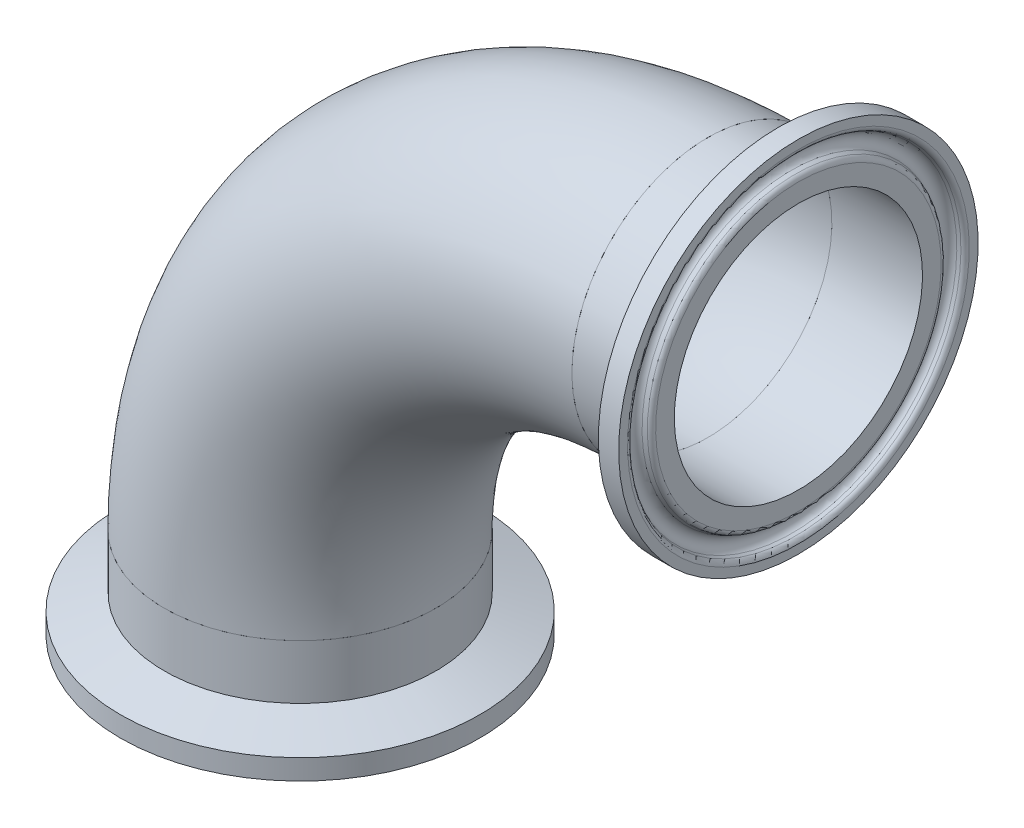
ISO-10303-21;
HEADER;
FILE_DESCRIPTION(('STEP AP214'),'2;1');
FILE_NAME('part.step','',(''),(''),'','','');
FILE_SCHEMA(('AUTOMOTIVE_DESIGN { 1 0 10303 214 1 1 1 1 }'));
ENDSEC;
DATA;
#1=APPLICATION_CONTEXT('core data for automotive mechanical design processes');
#2=APPLICATION_PROTOCOL_DEFINITION('international standard','automotive_design',2000,#1);
#3=PRODUCT_CONTEXT('',#1,'mechanical');
#4=PRODUCT('Part','Part','',(#3));
#5=PRODUCT_RELATED_PRODUCT_CATEGORY('part','',(#4));
#6=PRODUCT_DEFINITION_FORMATION('','',#4);
#7=PRODUCT_DEFINITION_CONTEXT('part definition',#1,'design');
#8=PRODUCT_DEFINITION('design','',#6,#7);
#9=PRODUCT_DEFINITION_SHAPE('','',#8);
#10=(LENGTH_UNIT() NAMED_UNIT(*) SI_UNIT(.MILLI.,.METRE.));
#11=(NAMED_UNIT(*) PLANE_ANGLE_UNIT() SI_UNIT($,.RADIAN.));
#12=(NAMED_UNIT(*) SI_UNIT($,.STERADIAN.) SOLID_ANGLE_UNIT());
#13=UNCERTAINTY_MEASURE_WITH_UNIT(LENGTH_MEASURE(1.E-05),#10,'distance_accuracy_value','');
#14=(GEOMETRIC_REPRESENTATION_CONTEXT(3) GLOBAL_UNCERTAINTY_ASSIGNED_CONTEXT((#13)) GLOBAL_UNIT_ASSIGNED_CONTEXT((#10,
#11,#12)) REPRESENTATION_CONTEXT('',''));
#15=CARTESIAN_POINT('',(0.,0.,0.));
#16=DIRECTION('',(0.,0.,1.));
#17=DIRECTION('',(1.,0.,0.));
#18=AXIS2_PLACEMENT_3D('',#15,#16,#17);
#19=CARTESIAN_POINT('',(88.4052383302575,87.114097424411,44.4344903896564));
#20=DIRECTION('',(-1.00000000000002,0.,0.));
#21=DIRECTION('',(0.,0.134581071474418,-0.990902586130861));
#22=AXIS2_PLACEMENT_3D('',#19,#20,#21);
#23=CONICAL_SURFACE('',#22,20.9336326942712,0.401425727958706);
#24=CARTESIAN_POINT('',(88.9249744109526,87.1140974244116,44.434490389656));
#25=DIRECTION('',(1.00000000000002,0.,0.));
#26=DIRECTION('',(0.,-0.134581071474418,0.990902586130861));
#27=AXIS2_PLACEMENT_3D('',#24,#25,#26);
#28=CIRCLE('',#27,20.7130178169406);
#29=CARTESIAN_POINT('',(88.9249744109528,84.326517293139,64.959073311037));
#30=VERTEX_POINT('',#29);
#31=EDGE_CURVE('P0_E9',#30,#30,#28,.T.);
#32=ORIENTED_EDGE('',*,*,#31,.F.);
#33=EDGE_LOOP('',(#32));
#34=FACE_BOUND('',#33,.T.);
#35=CARTESIAN_POINT('',(88.4052383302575,87.114097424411,44.4344903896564));
#36=DIRECTION('',(1.00000000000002,0.,0.));
#37=DIRECTION('',(0.,-0.134581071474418,0.990902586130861));
#38=AXIS2_PLACEMENT_3D('',#35,#36,#37);
#39=CIRCLE('',#38,20.9336326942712);
#40=CARTESIAN_POINT('',(88.4052383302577,84.296826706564,65.1776811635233));
#41=VERTEX_POINT('',#40);
#42=EDGE_CURVE('P0_E54',#41,#41,#39,.T.);
#43=ORIENTED_EDGE('',*,*,#42,.T.);
#44=EDGE_LOOP('',(#43));
#45=FACE_BOUND('',#44,.T.);
#46=ADVANCED_FACE('P0_F14',(#34,#45),#23,.T.);
#47=CARTESIAN_POINT('',(88.6272372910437,87.1140974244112,44.4344903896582));
#48=DIRECTION('',(1.00000000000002,0.,0.));
#49=DIRECTION('',(0.,-0.134581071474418,0.990902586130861));
#50=AXIS2_PLACEMENT_3D('',#47,#48,#49);
#51=TOROIDAL_SURFACE('',#50,20.0115931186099,0.761999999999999);
#52=CARTESIAN_POINT('',(89.3892372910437,87.1140974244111,44.4344903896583));
#53=DIRECTION('',(1.00000000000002,0.,0.));
#54=DIRECTION('',(0.,-0.134581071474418,0.990902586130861));
#55=AXIS2_PLACEMENT_3D('',#52,#53,#54);
#56=CIRCLE('',#55,20.0115931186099);
#57=CARTESIAN_POINT('',(89.389237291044,84.4209157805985,64.2640297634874));
#58=VERTEX_POINT('',#57);
#59=EDGE_CURVE('P0_E20',#58,#58,#56,.T.);
#60=ORIENTED_EDGE('',*,*,#59,.F.);
#61=EDGE_LOOP('',(#60));
#62=FACE_BOUND('',#61,.T.);
#63=ORIENTED_EDGE('',*,*,#31,.T.);
#64=EDGE_LOOP('',(#63));
#65=FACE_BOUND('',#64,.T.);
#66=ADVANCED_FACE('P0_F84',(#62,#65),#51,.T.);
#67=CARTESIAN_POINT('',(89.3892372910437,87.1140974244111,44.4344903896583));
#68=DIRECTION('',(-1.00000000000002,0.,0.));
#69=DIRECTION('',(0.,0.134581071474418,-0.990902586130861));
#70=AXIS2_PLACEMENT_3D('',#67,#68,#69);
#71=PLANE('',#70);
#72=CARTESIAN_POINT('',(89.3892372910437,87.1140974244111,44.4344903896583));
#73=DIRECTION('',(1.00000000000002,0.,0.));
#74=DIRECTION('',(0.,-0.134581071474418,0.990902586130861));
#75=AXIS2_PLACEMENT_3D('',#72,#73,#74);
#76=CIRCLE('',#75,17.399);
#77=CARTESIAN_POINT('',(89.3892372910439,84.7725213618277,61.6752044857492));
#78=VERTEX_POINT('',#77);
#79=EDGE_CURVE('P0_E24',#78,#78,#76,.T.);
#80=ORIENTED_EDGE('',*,*,#79,.F.);
#81=EDGE_LOOP('',(#80));
#82=FACE_BOUND('',#81,.T.);
#83=ORIENTED_EDGE('',*,*,#59,.T.);
#84=EDGE_LOOP('',(#83));
#85=FACE_BOUND('',#84,.T.);
#86=ADVANCED_FACE('P0_F89',(#82,#85),#71,.F.);
#87=CARTESIAN_POINT('',(89.3892372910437,87.1140974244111,44.4344903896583));
#88=DIRECTION('',(1.00000000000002,0.,0.));
#89=DIRECTION('',(0.,-0.134581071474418,0.990902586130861));
#90=AXIS2_PLACEMENT_3D('',#87,#88,#89);
#91=CYLINDRICAL_SURFACE('',#90,17.399);
#92=ORIENTED_EDGE('',*,*,#79,.T.);
#93=EDGE_LOOP('',(#92));
#94=FACE_BOUND('',#93,.T.);
#95=CARTESIAN_POINT('',(76.6892372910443,87.1140974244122,44.4344903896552));
#96=DIRECTION('',(1.00000000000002,0.,0.));
#97=DIRECTION('',(0.,-0.134581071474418,0.990902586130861));
#98=AXIS2_PLACEMENT_3D('',#95,#96,#97);
#99=CIRCLE('',#98,17.399);
#100=CARTESIAN_POINT('',(76.6892372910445,84.7725213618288,61.6752044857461));
#101=VERTEX_POINT('',#100);
#102=EDGE_CURVE('P0_E28',#101,#101,#99,.T.);
#103=ORIENTED_EDGE('',*,*,#102,.F.);
#104=EDGE_LOOP('',(#103));
#105=FACE_BOUND('',#104,.T.);
#106=ADVANCED_FACE('P0_F94',(#94,#105),#91,.F.);
#107=CARTESIAN_POINT('',(76.6892372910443,87.1140974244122,44.4344903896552));
#108=DIRECTION('',(1.00000000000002,0.,0.));
#109=DIRECTION('',(0.,-0.134581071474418,0.990902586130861));
#110=AXIS2_PLACEMENT_3D('',#107,#108,#109);
#111=PLANE('',#110);
#112=CARTESIAN_POINT('',(76.6892372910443,87.1140974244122,44.4344903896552));
#113=DIRECTION('',(1.00000000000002,0.,0.));
#114=DIRECTION('',(0.,-0.134581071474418,0.990902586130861));
#115=AXIS2_PLACEMENT_3D('',#112,#113,#114);
#116=CIRCLE('',#115,19.05);
#117=CARTESIAN_POINT('',(76.6892372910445,84.5503280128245,63.3111846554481));
#118=VERTEX_POINT('',#117);
#119=EDGE_CURVE('P0_E33',#118,#118,#116,.T.);
#120=ORIENTED_EDGE('',*,*,#119,.F.);
#121=EDGE_LOOP('',(#120));
#122=FACE_BOUND('',#121,.T.);
#123=ORIENTED_EDGE('',*,*,#102,.T.);
#124=EDGE_LOOP('',(#123));
#125=FACE_BOUND('',#124,.T.);
#126=ADVANCED_FACE('P0_F100',(#122,#125),#111,.F.);
#127=CARTESIAN_POINT('',(89.3892372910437,87.1140974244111,44.4344903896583));
#128=DIRECTION('',(1.00000000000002,0.,0.));
#129=DIRECTION('',(0.,-0.134581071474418,0.990902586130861));
#130=AXIS2_PLACEMENT_3D('',#127,#128,#129);
#131=CYLINDRICAL_SURFACE('',#130,19.05);
#132=CARTESIAN_POINT('',(84.3071850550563,87.1140974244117,44.4344903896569));
#133=DIRECTION('',(1.00000000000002,0.,0.));
#134=DIRECTION('',(0.,-0.134581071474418,0.990902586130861));
#135=AXIS2_PLACEMENT_3D('',#132,#133,#134);
#136=CIRCLE('',#135,19.05);
#137=CARTESIAN_POINT('',(84.3071850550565,84.5503280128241,63.3111846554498));
#138=VERTEX_POINT('',#137);
#139=EDGE_CURVE('P0_E36',#138,#138,#136,.T.);
#140=ORIENTED_EDGE('',*,*,#139,.F.);
#141=EDGE_LOOP('',(#140));
#142=FACE_BOUND('',#141,.T.);
#143=ORIENTED_EDGE('',*,*,#119,.T.);
#144=EDGE_LOOP('',(#143));
#145=FACE_BOUND('',#144,.T.);
#146=ADVANCED_FACE('P0_F104',(#142,#145),#131,.T.);
#147=CARTESIAN_POINT('',(84.3071850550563,87.1140974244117,44.4344903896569));
#148=DIRECTION('',(1.00000000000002,0.,0.));
#149=DIRECTION('',(0.,-0.134581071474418,0.990902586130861));
#150=AXIS2_PLACEMENT_3D('',#147,#148,#149);
#151=CONICAL_SURFACE('',#150,19.05,1.22173047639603);
#152=CARTESIAN_POINT('',(86.5444372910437,87.1140974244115,44.4344903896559));
#153=DIRECTION('',(1.00000000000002,0.,0.));
#154=DIRECTION('',(0.,-0.134581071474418,0.990902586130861));
#155=AXIS2_PLACEMENT_3D('',#152,#153,#154);
#156=CIRCLE('',#155,25.1968);
#157=CARTESIAN_POINT('',(86.544437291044,83.7230850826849,69.402064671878));
#158=VERTEX_POINT('',#157);
#159=EDGE_CURVE('P0_E39',#158,#158,#156,.T.);
#160=ORIENTED_EDGE('',*,*,#159,.F.);
#161=EDGE_LOOP('',(#160));
#162=FACE_BOUND('',#161,.T.);
#163=ORIENTED_EDGE('',*,*,#139,.T.);
#164=EDGE_LOOP('',(#163));
#165=FACE_BOUND('',#164,.T.);
#166=ADVANCED_FACE('P0_F108',(#162,#165),#151,.T.);
#167=CARTESIAN_POINT('',(89.3892372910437,87.1140974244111,44.4344903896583));
#168=DIRECTION('',(1.00000000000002,0.,0.));
#169=DIRECTION('',(0.,-0.134581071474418,0.990902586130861));
#170=AXIS2_PLACEMENT_3D('',#167,#168,#169);
#171=CYLINDRICAL_SURFACE('',#170,25.1968);
#172=CARTESIAN_POINT('',(89.3892372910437,87.1140974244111,44.4344903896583));
#173=DIRECTION('',(1.00000000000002,0.,0.));
#174=DIRECTION('',(0.,-0.134581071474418,0.990902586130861));
#175=AXIS2_PLACEMENT_3D('',#172,#173,#174);
#176=CIRCLE('',#175,25.1968);
#177=CARTESIAN_POINT('',(89.389237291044,83.7230850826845,69.4020646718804));
#178=VERTEX_POINT('',#177);
#179=EDGE_CURVE('P0_E42',#178,#178,#176,.T.);
#180=ORIENTED_EDGE('',*,*,#179,.F.);
#181=EDGE_LOOP('',(#180));
#182=FACE_BOUND('',#181,.T.);
#183=ORIENTED_EDGE('',*,*,#159,.T.);
#184=EDGE_LOOP('',(#183));
#185=FACE_BOUND('',#184,.T.);
#186=ADVANCED_FACE('P0_F80',(#182,#185),#171,.T.);
#187=CARTESIAN_POINT('',(89.3892372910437,87.1140974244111,44.4344903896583));
#188=DIRECTION('',(-1.00000000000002,0.,0.));
#189=DIRECTION('',(0.,0.134581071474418,-0.990902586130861));
#190=AXIS2_PLACEMENT_3D('',#187,#188,#189);
#191=PLANE('',#190);
#192=CARTESIAN_POINT('',(89.3892372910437,87.1140974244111,44.4344903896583));
#193=DIRECTION('',(1.00000000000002,0.,0.));
#194=DIRECTION('',(0.,-0.134581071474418,0.990902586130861));
#195=AXIS2_PLACEMENT_3D('',#192,#193,#194);
#196=CIRCLE('',#195,23.9521599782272);
#197=CARTESIAN_POINT('',(89.389237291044,83.8905900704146,68.1687476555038));
#198=VERTEX_POINT('',#197);
#199=EDGE_CURVE('P0_E45',#198,#198,#196,.T.);
#200=ORIENTED_EDGE('',*,*,#199,.F.);
#201=EDGE_LOOP('',(#200));
#202=FACE_BOUND('',#201,.T.);
#203=ORIENTED_EDGE('',*,*,#179,.T.);
#204=EDGE_LOOP('',(#203));
#205=FACE_BOUND('',#204,.T.);
#206=ADVANCED_FACE('P0_F73',(#202,#205),#191,.F.);
#207=CARTESIAN_POINT('',(88.6272372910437,87.1140974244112,44.4344903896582));
#208=DIRECTION('',(1.00000000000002,0.,0.));
#209=DIRECTION('',(0.,-0.134581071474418,0.990902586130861));
#210=AXIS2_PLACEMENT_3D('',#207,#208,#209);
#211=TOROIDAL_SURFACE('',#210,23.9521599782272,0.761999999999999);
#212=ORIENTED_EDGE('',*,*,#199,.T.);
#213=EDGE_LOOP('',(#212));
#214=FACE_BOUND('',#213,.T.);
#215=CARTESIAN_POINT('',(88.9249744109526,87.1140974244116,44.434490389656));
#216=DIRECTION('',(1.00000000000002,0.,0.));
#217=DIRECTION('',(0.,-0.134581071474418,0.990902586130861));
#218=AXIS2_PLACEMENT_3D('',#215,#216,#217);
#219=CIRCLE('',#218,23.2507352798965);
#220=CARTESIAN_POINT('',(88.9249744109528,83.984988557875,67.4737041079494));
#221=VERTEX_POINT('',#220);
#222=EDGE_CURVE('P0_E48',#221,#221,#219,.T.);
#223=ORIENTED_EDGE('',*,*,#222,.F.);
#224=EDGE_LOOP('',(#223));
#225=FACE_BOUND('',#224,.T.);
#226=ADVANCED_FACE('P0_F68',(#214,#225),#211,.T.);
#227=CARTESIAN_POINT('',(88.9249744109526,87.1140974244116,44.434490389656));
#228=DIRECTION('',(1.00000000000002,0.,0.));
#229=DIRECTION('',(0.,-0.134581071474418,0.990902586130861));
#230=AXIS2_PLACEMENT_3D('',#227,#228,#229);
#231=CONICAL_SURFACE('',#230,23.2507352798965,0.401425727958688);
#232=CARTESIAN_POINT('',(88.5163824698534,87.1140974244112,44.4344903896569));
#233=DIRECTION('',(1.00000000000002,0.,0.));
#234=DIRECTION('',(0.,-0.134581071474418,0.990902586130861));
#235=AXIS2_PLACEMENT_3D('',#232,#233,#234);
#236=CIRCLE('',#235,23.0772982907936);
#237=CARTESIAN_POINT('',(88.5163824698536,84.0083298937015,67.3018449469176));
#238=VERTEX_POINT('',#237);
#239=EDGE_CURVE('P0_E51',#238,#238,#236,.T.);
#240=ORIENTED_EDGE('',*,*,#239,.F.);
#241=EDGE_LOOP('',(#240));
#242=FACE_BOUND('',#241,.T.);
#243=ORIENTED_EDGE('',*,*,#222,.T.);
#244=EDGE_LOOP('',(#243));
#245=FACE_BOUND('',#244,.T.);
#246=ADVANCED_FACE('P0_F62',(#242,#245),#231,.F.);
#247=CARTESIAN_POINT('',(88.9828372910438,87.1140974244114,44.4344903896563));
#248=DIRECTION('',(1.00000000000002,0.,0.));
#249=DIRECTION('',(0.,-0.134581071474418,0.990902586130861));
#250=AXIS2_PLACEMENT_3D('',#247,#248,#249);
#251=TOROIDAL_SURFACE('',#250,21.9783995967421,1.1938);
#252=ORIENTED_EDGE('',*,*,#42,.F.);
#253=EDGE_LOOP('',(#252));
#254=FACE_BOUND('',#253,.T.);
#255=ORIENTED_EDGE('',*,*,#239,.T.);
#256=EDGE_LOOP('',(#255));
#257=FACE_BOUND('',#256,.T.);
#258=ADVANCED_FACE('P0_F59',(#254,#257),#251,.F.);
#259=CLOSED_SHELL('',(#46,#66,#86,#106,#126,#146,#166,#186,#206,#226,#246,#258));
#260=MANIFOLD_SOLID_BREP('P0_B1',#259);
#261=CARTESIAN_POINT('',(19.5392372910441,18.2480963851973,44.4344903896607));
#262=DIRECTION('',(0.,1.00000000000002,0.));
#263=DIRECTION('',(0.,0.,1.00000000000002));
#264=AXIS2_PLACEMENT_3D('',#261,#262,#263);
#265=CONICAL_SURFACE('',#264,20.9336326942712,0.401425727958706);
#266=CARTESIAN_POINT('',(19.5392372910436,17.7283603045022,44.4344903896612));
#267=DIRECTION('',(0.,-1.00000000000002,0.));
#268=DIRECTION('',(0.,0.,-1.00000000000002));
#269=AXIS2_PLACEMENT_3D('',#266,#267,#268);
#270=CIRCLE('',#269,20.7130178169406);
#271=CARTESIAN_POINT('',(19.5392372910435,17.7283603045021,23.7214725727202));
#272=VERTEX_POINT('',#271);
#273=EDGE_CURVE('P1_E10',#272,#272,#270,.T.);
#274=ORIENTED_EDGE('',*,*,#273,.F.);
#275=EDGE_LOOP('',(#274));
#276=FACE_BOUND('',#275,.T.);
#277=CARTESIAN_POINT('',(19.5392372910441,18.2480963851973,44.4344903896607));
#278=DIRECTION('',(0.,-1.00000000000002,0.));
#279=DIRECTION('',(0.,0.,-1.00000000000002));
#280=AXIS2_PLACEMENT_3D('',#277,#278,#279);
#281=CIRCLE('',#280,20.9336326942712);
#282=CARTESIAN_POINT('',(19.5392372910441,18.2480963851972,23.5008576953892));
#283=VERTEX_POINT('',#282);
#284=EDGE_CURVE('P1_E55',#283,#283,#281,.T.);
#285=ORIENTED_EDGE('',*,*,#284,.T.);
#286=EDGE_LOOP('',(#285));
#287=FACE_BOUND('',#286,.T.);
#288=ADVANCED_FACE('P1_F15',(#276,#287),#265,.T.);
#289=CARTESIAN_POINT('',(19.5392372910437,18.0260974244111,44.434490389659));
#290=DIRECTION('',(0.,-1.00000000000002,0.));
#291=DIRECTION('',(0.,0.,-1.00000000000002));
#292=AXIS2_PLACEMENT_3D('',#289,#290,#291);
#293=TOROIDAL_SURFACE('',#292,20.0115931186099,0.761999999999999);
#294=CARTESIAN_POINT('',(19.5392372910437,17.2640974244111,44.4344903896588));
#295=DIRECTION('',(0.,-1.00000000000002,0.));
#296=DIRECTION('',(0.,0.,-1.00000000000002));
#297=AXIS2_PLACEMENT_3D('',#294,#295,#296);
#298=CIRCLE('',#297,20.0115931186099);
#299=CARTESIAN_POINT('',(19.5392372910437,17.264097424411,24.4228972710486));
#300=VERTEX_POINT('',#299);
#301=EDGE_CURVE('P1_E21',#300,#300,#298,.T.);
#302=ORIENTED_EDGE('',*,*,#301,.F.);
#303=EDGE_LOOP('',(#302));
#304=FACE_BOUND('',#303,.T.);
#305=ORIENTED_EDGE('',*,*,#273,.T.);
#306=EDGE_LOOP('',(#305));
#307=FACE_BOUND('',#306,.T.);
#308=ADVANCED_FACE('P1_F85',(#304,#307),#293,.T.);
#309=CARTESIAN_POINT('',(19.5392372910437,17.2640974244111,44.4344903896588));
#310=DIRECTION('',(0.,1.00000000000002,0.));
#311=DIRECTION('',(0.,0.,1.00000000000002));
#312=AXIS2_PLACEMENT_3D('',#309,#310,#311);
#313=PLANE('',#312);
#314=CARTESIAN_POINT('',(19.5392372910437,17.2640974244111,44.4344903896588));
#315=DIRECTION('',(0.,-1.00000000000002,0.));
#316=DIRECTION('',(0.,0.,-1.00000000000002));
#317=AXIS2_PLACEMENT_3D('',#314,#315,#316);
#318=CIRCLE('',#317,17.399);
#319=CARTESIAN_POINT('',(19.5392372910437,17.264097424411,27.0354903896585));
#320=VERTEX_POINT('',#319);
#321=EDGE_CURVE('P1_E25',#320,#320,#318,.T.);
#322=ORIENTED_EDGE('',*,*,#321,.F.);
#323=EDGE_LOOP('',(#322));
#324=FACE_BOUND('',#323,.T.);
#325=ORIENTED_EDGE('',*,*,#301,.T.);
#326=EDGE_LOOP('',(#325));
#327=FACE_BOUND('',#326,.T.);
#328=ADVANCED_FACE('P1_F90',(#324,#327),#313,.F.);
#329=CARTESIAN_POINT('',(19.5392372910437,17.2640974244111,44.4344903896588));
#330=DIRECTION('',(0.,-1.00000000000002,0.));
#331=DIRECTION('',(0.,0.,-1.00000000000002));
#332=AXIS2_PLACEMENT_3D('',#329,#330,#331);
#333=CYLINDRICAL_SURFACE('',#332,17.399);
#334=ORIENTED_EDGE('',*,*,#321,.T.);
#335=EDGE_LOOP('',(#334));
#336=FACE_BOUND('',#335,.T.);
#337=CARTESIAN_POINT('',(19.5392372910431,29.9640974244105,44.4344903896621));
#338=DIRECTION('',(0.,-1.00000000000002,0.));
#339=DIRECTION('',(0.,0.,-1.00000000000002));
#340=AXIS2_PLACEMENT_3D('',#337,#338,#339);
#341=CIRCLE('',#340,17.399);
#342=CARTESIAN_POINT('',(19.539237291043,29.9640974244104,27.0354903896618));
#343=VERTEX_POINT('',#342);
#344=EDGE_CURVE('P1_E29',#343,#343,#341,.T.);
#345=ORIENTED_EDGE('',*,*,#344,.F.);
#346=EDGE_LOOP('',(#345));
#347=FACE_BOUND('',#346,.T.);
#348=ADVANCED_FACE('P1_F95',(#336,#347),#333,.F.);
#349=CARTESIAN_POINT('',(19.5392372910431,29.9640974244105,44.4344903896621));
#350=DIRECTION('',(0.,-1.00000000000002,0.));
#351=DIRECTION('',(0.,0.,-1.00000000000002));
#352=AXIS2_PLACEMENT_3D('',#349,#350,#351);
#353=PLANE('',#352);
#354=CARTESIAN_POINT('',(19.5392372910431,29.9640974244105,44.4344903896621));
#355=DIRECTION('',(0.,-1.00000000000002,0.));
#356=DIRECTION('',(0.,0.,-1.00000000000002));
#357=AXIS2_PLACEMENT_3D('',#354,#355,#356);
#358=CIRCLE('',#357,19.05);
#359=CARTESIAN_POINT('',(19.539237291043,29.9640974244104,25.3844903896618));
#360=VERTEX_POINT('',#359);
#361=EDGE_CURVE('P1_E34',#360,#360,#358,.T.);
#362=ORIENTED_EDGE('',*,*,#361,.F.);
#363=EDGE_LOOP('',(#362));
#364=FACE_BOUND('',#363,.T.);
#365=ORIENTED_EDGE('',*,*,#344,.T.);
#366=EDGE_LOOP('',(#365));
#367=FACE_BOUND('',#366,.T.);
#368=ADVANCED_FACE('P1_F101',(#364,#367),#353,.F.);
#369=CARTESIAN_POINT('',(19.5392372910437,17.2640974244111,44.4344903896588));
#370=DIRECTION('',(0.,-1.00000000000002,0.));
#371=DIRECTION('',(0.,0.,-1.00000000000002));
#372=AXIS2_PLACEMENT_3D('',#369,#370,#371);
#373=CYLINDRICAL_SURFACE('',#372,19.05);
#374=CARTESIAN_POINT('',(19.5392372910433,22.3461496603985,44.4344903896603));
#375=DIRECTION('',(0.,-1.00000000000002,0.));
#376=DIRECTION('',(0.,0.,-1.00000000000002));
#377=AXIS2_PLACEMENT_3D('',#374,#375,#376);
#378=CIRCLE('',#377,19.05);
#379=CARTESIAN_POINT('',(19.5392372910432,22.3461496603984,25.38449038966));
#380=VERTEX_POINT('',#379);
#381=EDGE_CURVE('P1_E37',#380,#380,#378,.T.);
#382=ORIENTED_EDGE('',*,*,#381,.F.);
#383=EDGE_LOOP('',(#382));
#384=FACE_BOUND('',#383,.T.);
#385=ORIENTED_EDGE('',*,*,#361,.T.);
#386=EDGE_LOOP('',(#385));
#387=FACE_BOUND('',#386,.T.);
#388=ADVANCED_FACE('P1_F105',(#384,#387),#373,.T.);
#389=CARTESIAN_POINT('',(19.5392372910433,22.3461496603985,44.4344903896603));
#390=DIRECTION('',(0.,-1.00000000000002,0.));
#391=DIRECTION('',(0.,0.,-1.00000000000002));
#392=AXIS2_PLACEMENT_3D('',#389,#390,#391);
#393=CONICAL_SURFACE('',#392,19.05,1.22173047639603);
#394=CARTESIAN_POINT('',(19.5392372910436,20.108897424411,44.4344903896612));
#395=DIRECTION('',(0.,-1.00000000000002,0.));
#396=DIRECTION('',(0.,0.,-1.00000000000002));
#397=AXIS2_PLACEMENT_3D('',#394,#395,#396);
#398=CIRCLE('',#397,25.1968);
#399=CARTESIAN_POINT('',(19.5392372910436,20.1088974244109,19.2376903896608));
#400=VERTEX_POINT('',#399);
#401=EDGE_CURVE('P1_E40',#400,#400,#398,.T.);
#402=ORIENTED_EDGE('',*,*,#401,.F.);
#403=EDGE_LOOP('',(#402));
#404=FACE_BOUND('',#403,.T.);
#405=ORIENTED_EDGE('',*,*,#381,.T.);
#406=EDGE_LOOP('',(#405));
#407=FACE_BOUND('',#406,.T.);
#408=ADVANCED_FACE('P1_F109',(#404,#407),#393,.T.);
#409=CARTESIAN_POINT('',(19.5392372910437,17.2640974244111,44.4344903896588));
#410=DIRECTION('',(0.,-1.00000000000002,0.));
#411=DIRECTION('',(0.,0.,-1.00000000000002));
#412=AXIS2_PLACEMENT_3D('',#409,#410,#411);
#413=CYLINDRICAL_SURFACE('',#412,25.1968);
#414=CARTESIAN_POINT('',(19.5392372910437,17.2640974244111,44.4344903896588));
#415=DIRECTION('',(0.,-1.00000000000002,0.));
#416=DIRECTION('',(0.,0.,-1.00000000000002));
#417=AXIS2_PLACEMENT_3D('',#414,#415,#416);
#418=CIRCLE('',#417,25.1968);
#419=CARTESIAN_POINT('',(19.5392372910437,17.2640974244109,19.2376903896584));
#420=VERTEX_POINT('',#419);
#421=EDGE_CURVE('P1_E43',#420,#420,#418,.T.);
#422=ORIENTED_EDGE('',*,*,#421,.F.);
#423=EDGE_LOOP('',(#422));
#424=FACE_BOUND('',#423,.T.);
#425=ORIENTED_EDGE('',*,*,#401,.T.);
#426=EDGE_LOOP('',(#425));
#427=FACE_BOUND('',#426,.T.);
#428=ADVANCED_FACE('P1_F81',(#424,#427),#413,.T.);
#429=CARTESIAN_POINT('',(19.5392372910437,17.2640974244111,44.4344903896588));
#430=DIRECTION('',(0.,1.00000000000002,0.));
#431=DIRECTION('',(0.,0.,1.00000000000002));
#432=AXIS2_PLACEMENT_3D('',#429,#430,#431);
#433=PLANE('',#432);
#434=CARTESIAN_POINT('',(19.5392372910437,17.2640974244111,44.4344903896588));
#435=DIRECTION('',(0.,-1.00000000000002,0.));
#436=DIRECTION('',(0.,0.,-1.00000000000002));
#437=AXIS2_PLACEMENT_3D('',#434,#435,#436);
#438=CIRCLE('',#437,23.9521599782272);
#439=CARTESIAN_POINT('',(19.5392372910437,17.2640974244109,20.4823304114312));
#440=VERTEX_POINT('',#439);
#441=EDGE_CURVE('P1_E46',#440,#440,#438,.T.);
#442=ORIENTED_EDGE('',*,*,#441,.F.);
#443=EDGE_LOOP('',(#442));
#444=FACE_BOUND('',#443,.T.);
#445=ORIENTED_EDGE('',*,*,#421,.T.);
#446=EDGE_LOOP('',(#445));
#447=FACE_BOUND('',#446,.T.);
#448=ADVANCED_FACE('P1_F74',(#444,#447),#433,.F.);
#449=CARTESIAN_POINT('',(19.5392372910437,18.0260974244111,44.434490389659));
#450=DIRECTION('',(0.,-1.00000000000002,0.));
#451=DIRECTION('',(0.,0.,-1.00000000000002));
#452=AXIS2_PLACEMENT_3D('',#449,#450,#451);
#453=TOROIDAL_SURFACE('',#452,23.9521599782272,0.761999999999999);
#454=ORIENTED_EDGE('',*,*,#441,.T.);
#455=EDGE_LOOP('',(#454));
#456=FACE_BOUND('',#455,.T.);
#457=CARTESIAN_POINT('',(19.5392372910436,17.7283603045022,44.4344903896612));
#458=DIRECTION('',(0.,-1.00000000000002,0.));
#459=DIRECTION('',(0.,0.,-1.00000000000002));
#460=AXIS2_PLACEMENT_3D('',#457,#458,#459);
#461=CIRCLE('',#460,23.2507352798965);
#462=CARTESIAN_POINT('',(19.5392372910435,17.7283603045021,21.1837551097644));
#463=VERTEX_POINT('',#462);
#464=EDGE_CURVE('P1_E49',#463,#463,#461,.T.);
#465=ORIENTED_EDGE('',*,*,#464,.F.);
#466=EDGE_LOOP('',(#465));
#467=FACE_BOUND('',#466,.T.);
#468=ADVANCED_FACE('P1_F69',(#456,#467),#453,.T.);
#469=CARTESIAN_POINT('',(19.5392372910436,17.7283603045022,44.4344903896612));
#470=DIRECTION('',(0.,-1.00000000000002,0.));
#471=DIRECTION('',(0.,0.,-1.00000000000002));
#472=AXIS2_PLACEMENT_3D('',#469,#470,#471);
#473=CONICAL_SURFACE('',#472,23.2507352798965,0.401425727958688);
#474=CARTESIAN_POINT('',(19.5392372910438,18.1369522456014,44.4344903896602));
#475=DIRECTION('',(0.,-1.00000000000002,0.));
#476=DIRECTION('',(0.,0.,-1.00000000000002));
#477=AXIS2_PLACEMENT_3D('',#474,#475,#476);
#478=CIRCLE('',#477,23.0772982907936);
#479=CARTESIAN_POINT('',(19.5392372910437,18.1369522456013,21.3571920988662));
#480=VERTEX_POINT('',#479);
#481=EDGE_CURVE('P1_E52',#480,#480,#478,.T.);
#482=ORIENTED_EDGE('',*,*,#481,.F.);
#483=EDGE_LOOP('',(#482));
#484=FACE_BOUND('',#483,.T.);
#485=ORIENTED_EDGE('',*,*,#464,.T.);
#486=EDGE_LOOP('',(#485));
#487=FACE_BOUND('',#486,.T.);
#488=ADVANCED_FACE('P1_F63',(#484,#487),#473,.F.);
#489=CARTESIAN_POINT('',(19.5392372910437,17.670497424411,44.4344903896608));
#490=DIRECTION('',(0.,-1.00000000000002,0.));
#491=DIRECTION('',(0.,0.,-1.00000000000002));
#492=AXIS2_PLACEMENT_3D('',#489,#490,#491);
#493=TOROIDAL_SURFACE('',#492,21.9783995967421,1.1938);
#494=ORIENTED_EDGE('',*,*,#284,.F.);
#495=EDGE_LOOP('',(#494));
#496=FACE_BOUND('',#495,.T.);
#497=ORIENTED_EDGE('',*,*,#481,.T.);
#498=EDGE_LOOP('',(#497));
#499=FACE_BOUND('',#498,.T.);
#500=ADVANCED_FACE('P1_F60',(#496,#499),#493,.F.);
#501=CLOSED_SHELL('',(#288,#308,#328,#348,#368,#388,#408,#428,#448,#468,#488,#500));
#502=MANIFOLD_SOLID_BREP('P1_B1',#501);
#503=CARTESIAN_POINT('',(76.6892372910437,29.9640974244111,44.4344903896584));
#504=DIRECTION('',(0.,0.,1.));
#505=DIRECTION('',(1.,0.,0.));
#506=AXIS2_PLACEMENT_3D('',#503,#504,#505);
#507=TOROIDAL_SURFACE('',#506,57.15,19.05);
#508=CARTESIAN_POINT('',(76.6892372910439,87.1140974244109,44.4344903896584));
#509=DIRECTION('',(1.,0.,0.));
#510=DIRECTION('',(0.,0.,-1.));
#511=AXIS2_PLACEMENT_3D('',#508,#509,#510);
#512=CIRCLE('',#511,19.05);
#513=CARTESIAN_POINT('',(76.6892372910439,106.164097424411,44.4344903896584));
#514=VERTEX_POINT('',#513);
#515=EDGE_CURVE('P2_E10',#514,#514,#512,.T.);
#516=CARTESIAN_POINT('',(19.5392372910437,29.96409742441,44.4344903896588));
#517=DIRECTION('',(0.,1.,0.));
#518=DIRECTION('',(0.,0.,-1.));
#519=AXIS2_PLACEMENT_3D('',#516,#517,#518);
#520=CIRCLE('',#519,19.05);
#521=CARTESIAN_POINT('',(0.489237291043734,29.9640974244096,44.4344903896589));
#522=VERTEX_POINT('',#521);
#523=EDGE_CURVE('P2_E21',#522,#522,#520,.T.);
#524=CARTESIAN_POINT('',(76.6892372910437,29.9640974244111,44.4344903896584));
#525=DIRECTION('',(0.,0.,1.));
#526=DIRECTION('',(1.,0.,0.));
#527=AXIS2_PLACEMENT_3D('',#524,#525,#526);
#528=CIRCLE('',#527,76.2);
#529=EDGE_CURVE('',#514,#522,#528,.T.);
#530=ORIENTED_EDGE('',*,*,#515,.F.);
#531=ORIENTED_EDGE('',*,*,#523,.T.);
#532=ORIENTED_EDGE('',*,*,#529,.T.);
#533=ORIENTED_EDGE('',*,*,#529,.F.);
#534=EDGE_LOOP('',(#530,#532,#531,#533));
#535=FACE_BOUND('',#534,.T.);
#536=ADVANCED_FACE('P2_F15',(#535),#507,.T.);
#537=CARTESIAN_POINT('',(76.6892372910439,87.1140974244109,44.4344903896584));
#538=DIRECTION('',(1.,0.,0.));
#539=DIRECTION('',(0.,0.,-1.));
#540=AXIS2_PLACEMENT_3D('',#537,#538,#539);
#541=PLANE('',#540);
#542=CARTESIAN_POINT('',(76.6892372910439,87.1140974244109,44.4344903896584));
#543=DIRECTION('',(1.,0.,0.));
#544=DIRECTION('',(0.,-1.,0.));
#545=AXIS2_PLACEMENT_3D('',#542,#543,#544);
#546=CIRCLE('',#545,17.399);
#547=CARTESIAN_POINT('',(76.6892372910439,104.513097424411,44.4344903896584));
#548=VERTEX_POINT('',#547);
#549=EDGE_CURVE('P2_E25',#548,#548,#546,.T.);
#550=ORIENTED_EDGE('',*,*,#549,.F.);
#551=EDGE_LOOP('',(#550));
#552=FACE_BOUND('',#551,.T.);
#553=ORIENTED_EDGE('',*,*,#515,.T.);
#554=EDGE_LOOP('',(#553));
#555=FACE_BOUND('',#554,.T.);
#556=ADVANCED_FACE('P2_F46',(#552,#555),#541,.T.);
#557=CARTESIAN_POINT('',(19.5392372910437,29.96409742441,44.4344903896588));
#558=DIRECTION('',(0.,1.,0.));
#559=DIRECTION('',(0.,0.,-1.));
#560=AXIS2_PLACEMENT_3D('',#557,#558,#559);
#561=PLANE('',#560);
#562=CARTESIAN_POINT('',(19.5392372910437,29.96409742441,44.4344903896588));
#563=DIRECTION('',(0.,1.,0.));
#564=DIRECTION('',(0.,0.,-1.));
#565=AXIS2_PLACEMENT_3D('',#562,#563,#564);
#566=CIRCLE('',#565,17.399);
#567=CARTESIAN_POINT('',(2.14023729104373,29.9640974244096,44.4344903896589));
#568=VERTEX_POINT('',#567);
#569=EDGE_CURVE('P2_E29',#568,#568,#566,.T.);
#570=ORIENTED_EDGE('',*,*,#569,.T.);
#571=EDGE_LOOP('',(#570));
#572=FACE_BOUND('',#571,.T.);
#573=ORIENTED_EDGE('',*,*,#523,.F.);
#574=EDGE_LOOP('',(#573));
#575=FACE_BOUND('',#574,.T.);
#576=ADVANCED_FACE('P2_F35',(#572,#575),#561,.F.);
#577=CARTESIAN_POINT('',(76.6892372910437,29.9640974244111,44.4344903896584));
#578=DIRECTION('',(0.,0.,1.));
#579=DIRECTION('',(1.,0.,0.));
#580=AXIS2_PLACEMENT_3D('',#577,#578,#579);
#581=TOROIDAL_SURFACE('',#580,57.15,17.399);
#582=CARTESIAN_POINT('',(76.6892372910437,29.9640974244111,44.4344903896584));
#583=DIRECTION('',(0.,0.,1.));
#584=DIRECTION('',(1.,0.,0.));
#585=AXIS2_PLACEMENT_3D('',#582,#583,#584);
#586=CIRCLE('',#585,74.549);
#587=EDGE_CURVE('',#548,#568,#586,.T.);
#588=ORIENTED_EDGE('',*,*,#549,.T.);
#589=ORIENTED_EDGE('',*,*,#569,.F.);
#590=ORIENTED_EDGE('',*,*,#587,.T.);
#591=ORIENTED_EDGE('',*,*,#587,.F.);
#592=EDGE_LOOP('',(#588,#590,#589,#591));
#593=FACE_BOUND('',#592,.T.);
#594=ADVANCED_FACE('P2_F38',(#593),#581,.F.);
#595=CLOSED_SHELL('',(#536,#556,#576,#594));
#596=MANIFOLD_SOLID_BREP('P2_B1',#595);
#597=ADVANCED_BREP_SHAPE_REPRESENTATION('',(#18,#260,#502,#596),#14);
#598=SHAPE_DEFINITION_REPRESENTATION(#9,#597);
ENDSEC;
END-ISO-10303-21;
